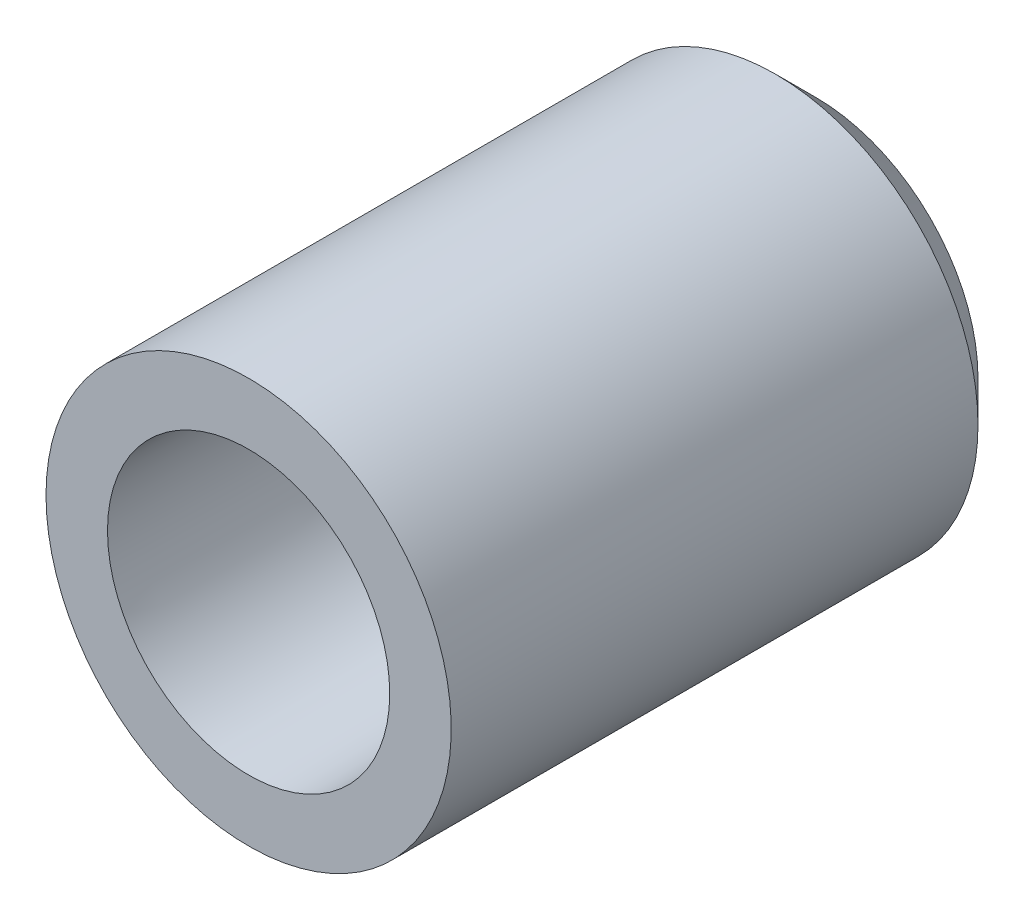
ISO-10303-21;
HEADER;
FILE_DESCRIPTION(('STEP AP214'),'2;1');
FILE_NAME('part.step','',(''),(''),'','','');
FILE_SCHEMA(('AUTOMOTIVE_DESIGN { 1 0 10303 214 1 1 1 1 }'));
ENDSEC;
DATA;
#1=APPLICATION_CONTEXT('core data for automotive mechanical design processes');
#2=APPLICATION_PROTOCOL_DEFINITION('international standard','automotive_design',2000,#1);
#3=PRODUCT_CONTEXT('',#1,'mechanical');
#4=PRODUCT('Part','Part','',(#3));
#5=PRODUCT_RELATED_PRODUCT_CATEGORY('part','',(#4));
#6=PRODUCT_DEFINITION_FORMATION('','',#4);
#7=PRODUCT_DEFINITION_CONTEXT('part definition',#1,'design');
#8=PRODUCT_DEFINITION('design','',#6,#7);
#9=PRODUCT_DEFINITION_SHAPE('','',#8);
#10=(LENGTH_UNIT() NAMED_UNIT(*) SI_UNIT(.MILLI.,.METRE.));
#11=(NAMED_UNIT(*) PLANE_ANGLE_UNIT() SI_UNIT($,.RADIAN.));
#12=(NAMED_UNIT(*) SI_UNIT($,.STERADIAN.) SOLID_ANGLE_UNIT());
#13=UNCERTAINTY_MEASURE_WITH_UNIT(LENGTH_MEASURE(1.E-05),#10,'distance_accuracy_value','');
#14=(GEOMETRIC_REPRESENTATION_CONTEXT(3) GLOBAL_UNCERTAINTY_ASSIGNED_CONTEXT((#13)) GLOBAL_UNIT_ASSIGNED_CONTEXT((#10,
#11,#12)) REPRESENTATION_CONTEXT('',''));
#15=CARTESIAN_POINT('',(0.,0.,0.));
#16=DIRECTION('',(0.,0.,1.));
#17=DIRECTION('',(1.,0.,0.));
#18=AXIS2_PLACEMENT_3D('',#15,#16,#17);
#19=CARTESIAN_POINT('',(0.,0.,-6.59363327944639));
#20=DIRECTION('',(0.,0.,1.));
#21=DIRECTION('',(1.,0.,0.));
#22=AXIS2_PLACEMENT_3D('',#19,#20,#21);
#23=CONICAL_SURFACE('',#22,4.8016363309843,0.785398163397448);
#24=CARTESIAN_POINT('',(0.,0.,-9.));
#25=DIRECTION('',(0.,0.,1.));
#26=DIRECTION('',(-1.,0.,0.));
#27=AXIS2_PLACEMENT_3D('',#24,#25,#26);
#28=CIRCLE('',#27,2.39526961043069);
#29=CARTESIAN_POINT('',(2.39526961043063,0.,-9.));
#30=VERTEX_POINT('',#29);
#31=CARTESIAN_POINT('',(-2.39526961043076,0.,-9.));
#32=VERTEX_POINT('',#31);
#33=EDGE_CURVE('E143',#30,#32,#28,.T.);
#34=ORIENTED_EDGE('',*,*,#33,.F.);
#35=CARTESIAN_POINT('',(2.39527123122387,0.,-8.99999837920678));
#36=CARTESIAN_POINT('',(3.39527046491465,0.,-7.99999914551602));
#37=B_SPLINE_CURVE_WITH_KNOTS('',1,(#35,#36),.UNSPECIFIED.,.F.,.F.,(2,2),(0.498844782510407,
0.707106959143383),.UNSPECIFIED.);
#38=CARTESIAN_POINT('',(3.39526961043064,0.,-8.));
#39=VERTEX_POINT('',#38);
#40=EDGE_CURVE('E44',#30,#39,#37,.T.);
#41=ORIENTED_EDGE('',*,*,#40,.T.);
#42=CARTESIAN_POINT('',(0.,0.,-8.));
#43=DIRECTION('',(0.,0.,-1.));
#44=DIRECTION('',(-1.,0.,0.));
#45=AXIS2_PLACEMENT_3D('',#42,#43,#44);
#46=CIRCLE('',#45,3.39526961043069);
#47=CARTESIAN_POINT('',(-3.39526961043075,0.,-8.));
#48=VERTEX_POINT('',#47);
#49=EDGE_CURVE('E11',#48,#39,#46,.T.);
#50=ORIENTED_EDGE('',*,*,#49,.F.);
#51=CARTESIAN_POINT('',(0.,0.,-8.));
#52=DIRECTION('',(0.,0.,-1.));
#53=DIRECTION('',(-1.,0.,0.));
#54=AXIS2_PLACEMENT_3D('',#51,#52,#53);
#55=CIRCLE('',#54,3.39526961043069);
#56=EDGE_CURVE('E51',#39,#48,#55,.T.);
#57=ORIENTED_EDGE('',*,*,#56,.F.);
#58=ORIENTED_EDGE('',*,*,#40,.F.);
#59=CARTESIAN_POINT('',(0.,0.,-9.));
#60=DIRECTION('',(0.,0.,1.));
#61=DIRECTION('',(-1.,0.,0.));
#62=AXIS2_PLACEMENT_3D('',#59,#60,#61);
#63=CIRCLE('',#62,2.39526961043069);
#64=EDGE_CURVE('E59',#32,#30,#63,.T.);
#65=ORIENTED_EDGE('',*,*,#64,.F.);
#66=EDGE_LOOP('',(#34,#41,#50,#57,#58,#65));
#67=FACE_BOUND('',#66,.T.);
#68=ADVANCED_FACE('F36',(#67),#23,.F.);
#69=CARTESIAN_POINT('',(0.,0.,-7.5));
#70=DIRECTION('',(0.,0.,-1.));
#71=DIRECTION('',(-1.,0.,0.));
#72=AXIS2_PLACEMENT_3D('',#69,#70,#71);
#73=CYLINDRICAL_SURFACE('',#72,3.39526961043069);
#74=CARTESIAN_POINT('',(0.,0.,-6.));
#75=DIRECTION('',(0.,0.,-1.));
#76=DIRECTION('',(-1.,0.,0.));
#77=AXIS2_PLACEMENT_3D('',#74,#75,#76);
#78=CIRCLE('',#77,3.39526961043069);
#79=CARTESIAN_POINT('',(-3.39526961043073,0.,-6.));
#80=VERTEX_POINT('',#79);
#81=EDGE_CURVE('E152',#80,#80,#78,.T.);
#82=ORIENTED_EDGE('',*,*,#81,.F.);
#83=CARTESIAN_POINT('',(-3.39526961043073,0.,-5.99999694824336));
#84=CARTESIAN_POINT('',(-3.39526961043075,0.,-8.000002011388));
#85=B_SPLINE_CURVE_WITH_KNOTS('',1,(#83,#84),.UNSPECIFIED.,.F.,.F.,(2,2),(0.0833320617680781,
0.91666750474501),.UNSPECIFIED.);
#86=EDGE_CURVE('E147',#80,#48,#85,.T.);
#87=ORIENTED_EDGE('',*,*,#86,.T.);
#88=ORIENTED_EDGE('',*,*,#49,.T.);
#89=ORIENTED_EDGE('',*,*,#56,.T.);
#90=ORIENTED_EDGE('',*,*,#86,.F.);
#91=EDGE_LOOP('',(#82,#87,#88,#89,#90));
#92=FACE_BOUND('',#91,.T.);
#93=ADVANCED_FACE('F191',(#92),#73,.F.);
#94=CARTESIAN_POINT('',(5.50912010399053,-4.97847439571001,-9.));
#95=DIRECTION('',(0.,0.,-1.));
#96=DIRECTION('',(-1.,0.,0.));
#97=AXIS2_PLACEMENT_3D('',#94,#95,#96);
#98=PLANE('',#97);
#99=CARTESIAN_POINT('',(-1.047339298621E-13,0.,-8.99999999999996));
#100=DIRECTION('',(0.,0.,-1.));
#101=DIRECTION('',(-1.,0.,0.));
#102=AXIS2_PLACEMENT_3D('',#99,#100,#101);
#103=CIRCLE('',#102,1.64999999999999);
#104=CARTESIAN_POINT('',(-1.6500000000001,0.,-8.99999999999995));
#105=VERTEX_POINT('',#104);
#106=EDGE_CURVE('E103',#105,#105,#103,.T.);
#107=ORIENTED_EDGE('',*,*,#106,.T.);
#108=EDGE_LOOP('',(#107));
#109=FACE_BOUND('',#108,.T.);
#110=ORIENTED_EDGE('',*,*,#64,.T.);
#111=ORIENTED_EDGE('',*,*,#33,.T.);
#112=EDGE_LOOP('',(#110,#111));
#113=FACE_BOUND('',#112,.T.);
#114=ADVANCED_FACE('F193',(#109,#113),#98,.F.);
#115=CARTESIAN_POINT('',(0.,0.,-1.));
#116=DIRECTION('',(0.,0.,1.));
#117=DIRECTION('',(-1.,0.,0.));
#118=AXIS2_PLACEMENT_3D('',#115,#116,#117);
#119=CONICAL_SURFACE('',#118,3.48254493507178,0.0174532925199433);
#120=ORIENTED_EDGE('',*,*,#81,.T.);
#121=CARTESIAN_POINT('',(-3.39526961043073,0.,-6.));
#122=CARTESIAN_POINT('',(-3.48254493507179,0.,-0.999999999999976));
#123=B_SPLINE_CURVE_WITH_KNOTS('',1,(#121,#122),.UNSPECIFIED.,.F.,.F.,(2,2),(0.,1.),.UNSPECIFIED.);
#124=CARTESIAN_POINT('',(-3.48254493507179,0.,-0.999999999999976));
#125=VERTEX_POINT('',#124);
#126=EDGE_CURVE('E108',#80,#125,#123,.T.);
#127=ORIENTED_EDGE('',*,*,#126,.T.);
#128=CARTESIAN_POINT('',(0.,0.,-1.));
#129=DIRECTION('',(0.,0.,-1.));
#130=DIRECTION('',(1.,0.,0.));
#131=AXIS2_PLACEMENT_3D('',#128,#129,#130);
#132=CIRCLE('',#131,3.48254493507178);
#133=CARTESIAN_POINT('',(3.48254493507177,0.,-1.00000000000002));
#134=VERTEX_POINT('',#133);
#135=EDGE_CURVE('E133',#134,#125,#132,.T.);
#136=ORIENTED_EDGE('',*,*,#135,.F.);
#137=CARTESIAN_POINT('',(0.,0.,-1.));
#138=DIRECTION('',(0.,0.,-1.));
#139=DIRECTION('',(1.,0.,0.));
#140=AXIS2_PLACEMENT_3D('',#137,#138,#139);
#141=CIRCLE('',#140,3.48254493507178);
#142=EDGE_CURVE('E126',#125,#134,#141,.T.);
#143=ORIENTED_EDGE('',*,*,#142,.F.);
#144=ORIENTED_EDGE('',*,*,#126,.F.);
#145=EDGE_LOOP('',(#120,#127,#136,#143,#144));
#146=FACE_BOUND('',#145,.T.);
#147=ADVANCED_FACE('F189',(#146),#119,.F.);
#148=CARTESIAN_POINT('',(0.,0.,-11.9289321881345));
#149=DIRECTION('',(0.,0.,1.));
#150=DIRECTION('',(1.,0.,0.));
#151=AXIS2_PLACEMENT_3D('',#148,#149,#150);
#152=CONICAL_SURFACE('',#151,7.07106781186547,0.785398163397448);
#153=CARTESIAN_POINT('',(-1.04744440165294E-13,0.,-15.));
#154=DIRECTION('',(0.,0.,1.));
#155=DIRECTION('',(-1.,0.,0.));
#156=AXIS2_PLACEMENT_3D('',#153,#154,#155);
#157=CIRCLE('',#156,4.);
#158=CARTESIAN_POINT('',(-4.0000000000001,0.,-15.));
#159=VERTEX_POINT('',#158);
#160=CARTESIAN_POINT('',(3.9999999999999,0.,-15.));
#161=VERTEX_POINT('',#160);
#162=EDGE_CURVE('E90',#159,#161,#157,.T.);
#163=ORIENTED_EDGE('',*,*,#162,.T.);
#164=CARTESIAN_POINT('',(4.00000161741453,0.,-14.9999983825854));
#165=CARTESIAN_POINT('',(5.00000126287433,0.,-13.9999987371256));
#166=B_SPLINE_CURVE_WITH_KNOTS('',1,(#164,#165),.UNSPECIFIED.,.F.,.F.,(2,2),(0.56568565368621,
0.707106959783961),.UNSPECIFIED.);
#167=CARTESIAN_POINT('',(4.9999999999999,0.,-14.));
#168=VERTEX_POINT('',#167);
#169=EDGE_CURVE('E95',#161,#168,#166,.T.);
#170=ORIENTED_EDGE('',*,*,#169,.T.);
#171=CARTESIAN_POINT('',(0.,0.,-14.));
#172=DIRECTION('',(0.,0.,-1.));
#173=DIRECTION('',(-1.,0.,0.));
#174=AXIS2_PLACEMENT_3D('',#171,#172,#173);
#175=CIRCLE('',#174,5.);
#176=CARTESIAN_POINT('',(-5.0000000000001,0.,-14.));
#177=VERTEX_POINT('',#176);
#178=EDGE_CURVE('E102',#168,#177,#175,.T.);
#179=ORIENTED_EDGE('',*,*,#178,.T.);
#180=CARTESIAN_POINT('',(0.,0.,-14.));
#181=DIRECTION('',(0.,0.,-1.));
#182=DIRECTION('',(-1.,0.,0.));
#183=AXIS2_PLACEMENT_3D('',#180,#181,#182);
#184=CIRCLE('',#183,5.);
#185=EDGE_CURVE('E105',#177,#168,#184,.T.);
#186=ORIENTED_EDGE('',*,*,#185,.T.);
#187=ORIENTED_EDGE('',*,*,#169,.F.);
#188=CARTESIAN_POINT('',(-1.04744440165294E-13,0.,-15.));
#189=DIRECTION('',(0.,0.,1.));
#190=DIRECTION('',(-1.,0.,0.));
#191=AXIS2_PLACEMENT_3D('',#188,#189,#190);
#192=CIRCLE('',#191,4.);
#193=EDGE_CURVE('E97',#161,#159,#192,.T.);
#194=ORIENTED_EDGE('',*,*,#193,.T.);
#195=EDGE_LOOP('',(#163,#170,#179,#186,#187,#194));
#196=FACE_BOUND('',#195,.T.);
#197=ADVANCED_FACE('F92',(#196),#152,.T.);
#198=CARTESIAN_POINT('',(0.,0.,-8.));
#199=DIRECTION('',(0.,0.,-1.));
#200=DIRECTION('',(-1.,0.,0.));
#201=AXIS2_PLACEMENT_3D('',#198,#199,#200);
#202=CYLINDRICAL_SURFACE('',#201,5.);
#203=CARTESIAN_POINT('',(0.,0.,-1.));
#204=DIRECTION('',(0.,0.,1.));
#205=DIRECTION('',(-1.,0.,0.));
#206=AXIS2_PLACEMENT_3D('',#203,#204,#205);
#207=CIRCLE('',#206,5.);
#208=CARTESIAN_POINT('',(-5.,0.,-0.999999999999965));
#209=VERTEX_POINT('',#208);
#210=EDGE_CURVE('E99',#209,#209,#207,.T.);
#211=ORIENTED_EDGE('',*,*,#210,.F.);
#212=CARTESIAN_POINT('',(-5.,0.,-1.00000099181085));
#213=CARTESIAN_POINT('',(-5.0000000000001,0.,-14.0000013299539));
#214=B_SPLINE_CURVE_WITH_KNOTS('',1,(#212,#213),.UNSPECIFIED.,.F.,.F.,(2,2),(0.0833333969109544,
0.916666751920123),.UNSPECIFIED.);
#215=EDGE_CURVE('E173',#209,#177,#214,.T.);
#216=ORIENTED_EDGE('',*,*,#215,.T.);
#217=ORIENTED_EDGE('',*,*,#178,.F.);
#218=ORIENTED_EDGE('',*,*,#185,.F.);
#219=ORIENTED_EDGE('',*,*,#215,.F.);
#220=EDGE_LOOP('',(#211,#216,#217,#218,#219));
#221=FACE_BOUND('',#220,.T.);
#222=ADVANCED_FACE('F225',(#221),#202,.T.);
#223=CARTESIAN_POINT('',(9.1999999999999,-8.31384387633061,-15.));
#224=DIRECTION('',(0.,0.,-1.));
#225=DIRECTION('',(-1.,0.,0.));
#226=AXIS2_PLACEMENT_3D('',#223,#224,#225);
#227=PLANE('',#226);
#228=CARTESIAN_POINT('',(-1.047339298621E-13,0.,-14.9999999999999));
#229=DIRECTION('',(0.,0.,-1.));
#230=DIRECTION('',(-1.,0.,0.));
#231=AXIS2_PLACEMENT_3D('',#228,#229,#230);
#232=CIRCLE('',#231,1.64999999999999);
#233=CARTESIAN_POINT('',(-1.65000000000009,0.,-14.9999999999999));
#234=VERTEX_POINT('',#233);
#235=EDGE_CURVE('E275',#234,#234,#232,.T.);
#236=ORIENTED_EDGE('',*,*,#235,.F.);
#237=EDGE_LOOP('',(#236));
#238=FACE_BOUND('',#237,.T.);
#239=ORIENTED_EDGE('',*,*,#193,.F.);
#240=ORIENTED_EDGE('',*,*,#162,.F.);
#241=EDGE_LOOP('',(#239,#240));
#242=FACE_BOUND('',#241,.T.);
#243=ADVANCED_FACE('F101',(#238,#242),#227,.T.);
#244=CARTESIAN_POINT('',(-6.5,-10.3923048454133,-0.999999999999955));
#245=DIRECTION('',(0.,0.,1.));
#246=DIRECTION('',(1.,0.,0.));
#247=AXIS2_PLACEMENT_3D('',#244,#245,#246);
#248=PLANE('',#247);
#249=ORIENTED_EDGE('',*,*,#210,.T.);
#250=EDGE_LOOP('',(#249));
#251=FACE_BOUND('',#250,.T.);
#252=ORIENTED_EDGE('',*,*,#135,.T.);
#253=ORIENTED_EDGE('',*,*,#142,.T.);
#254=EDGE_LOOP('',(#252,#253));
#255=FACE_BOUND('',#254,.T.);
#256=ADVANCED_FACE('F240',(#251,#255),#248,.T.);
#257=CARTESIAN_POINT('',(-1.047339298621E-13,0.,-14.9999999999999));
#258=DIRECTION('',(0.,0.,-1.));
#259=DIRECTION('',(-1.,0.,0.));
#260=AXIS2_PLACEMENT_3D('',#257,#258,#259);
#261=CYLINDRICAL_SURFACE('',#260,1.64999999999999);
#262=ORIENTED_EDGE('',*,*,#235,.T.);
#263=EDGE_LOOP('',(#262));
#264=FACE_BOUND('',#263,.T.);
#265=ORIENTED_EDGE('',*,*,#106,.F.);
#266=EDGE_LOOP('',(#265));
#267=FACE_BOUND('',#266,.T.);
#268=ADVANCED_FACE('F248',(#264,#267),#261,.F.);
#269=CLOSED_SHELL('',(#68,#93,#114,#147,#197,#222,#243,#256,#268));
#270=MANIFOLD_SOLID_BREP('B2',#269);
#271=ADVANCED_BREP_SHAPE_REPRESENTATION('',(#18,#270),#14);
#272=SHAPE_DEFINITION_REPRESENTATION(#9,#271);
ENDSEC;
END-ISO-10303-21;
